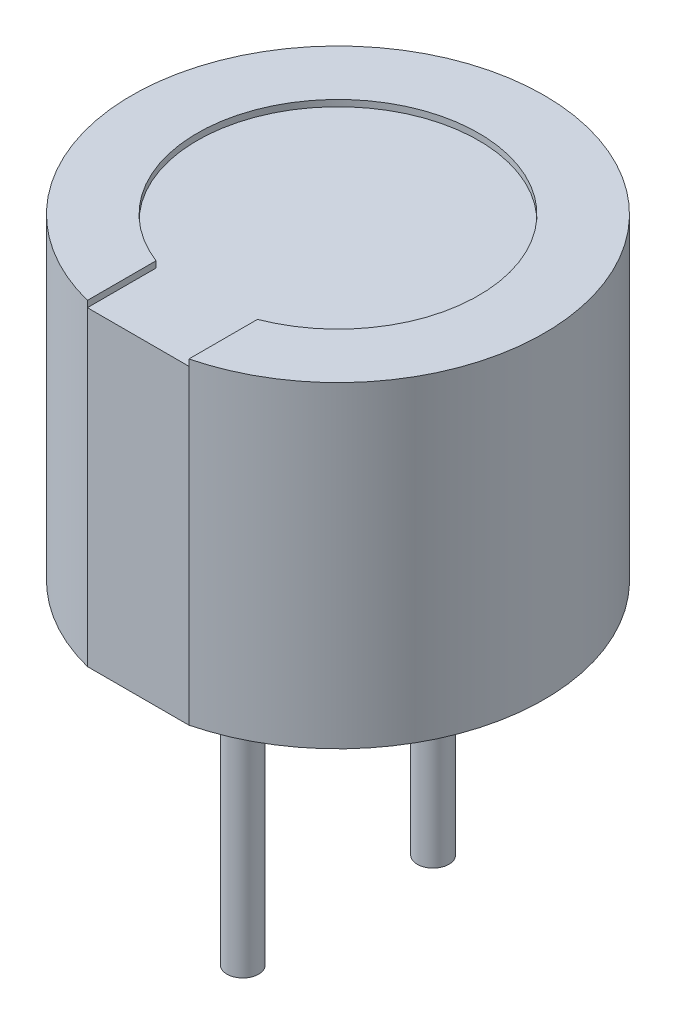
from build123d import *

# Parameters (mm, degrees)
ESQUISSE1_R             = 3.25
EXTRUSION1_DEPTH        = 5
ESQUISSE2_W             = 2
ESQUISSE2_H             = 5
ENL_V_MAT_EXTRU_1_DEPTH = 0.1
ESQUISSE3_R             = 0.25
EXTRUSION2_DEPTH        = 4.5
ENL_V_MAT_EXTRU_2_DEPTH = 0.1


with BuildPart() as part:
    # Esquisse1 → Extrusion1 (new body)
    with BuildSketch(Plane(origin=(0, 0, 0), x_dir=(1, 0, 0), z_dir=(0, 1, 0))):
        with Locations(Location((0, 0, 0), (0, 0, 270))):
            Circle(ESQUISSE1_R)
    extrude(amount=EXTRUSION1_DEPTH)

    # Esquisse2 → Enl_v. mat.-Extru.1 (cut)
    with BuildSketch(Plane.XY.offset(3.25)):
        with Locations((0, 2.5)):
            Rectangle(ESQUISSE2_W, ESQUISSE2_H)
    extrude(amount=-ENL_V_MAT_EXTRU_1_DEPTH, mode=Mode.SUBTRACT)

    # Esquisse3 → Extrusion2 (add)
    with BuildSketch(Plane.XZ):
        with Locations(Location((0, 1.5, 0), (0, 0, 90))):
            Circle(ESQUISSE3_R)
        with Locations(Location((0, -1.5, 0), (0, 0, 90))):
            Circle(ESQUISSE3_R)
    extrude(amount=EXTRUSION2_DEPTH)

    # Esquisse4 → Enl_v. mat.-Extru.2 (cut)
    with BuildSketch(Plane(origin=(0, 5, 0), x_dir=(-1, 0, 0), z_dir=(0, 1, 0))):
        with BuildLine():
            Line((-0.8, 2.068763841), (-0.8, 3.15))
            Line((-0.8, 3.15), (0.8, 3.15))
            Line((0.8, 3.15), (0.8, 2.068763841))
            ThreePointArc((0.8, 2.068763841), (0, -2.218058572), (-0.8, 2.068763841))
        make_face()
    extrude(amount=-ENL_V_MAT_EXTRU_2_DEPTH, mode=Mode.SUBTRACT)


solid = part.part
